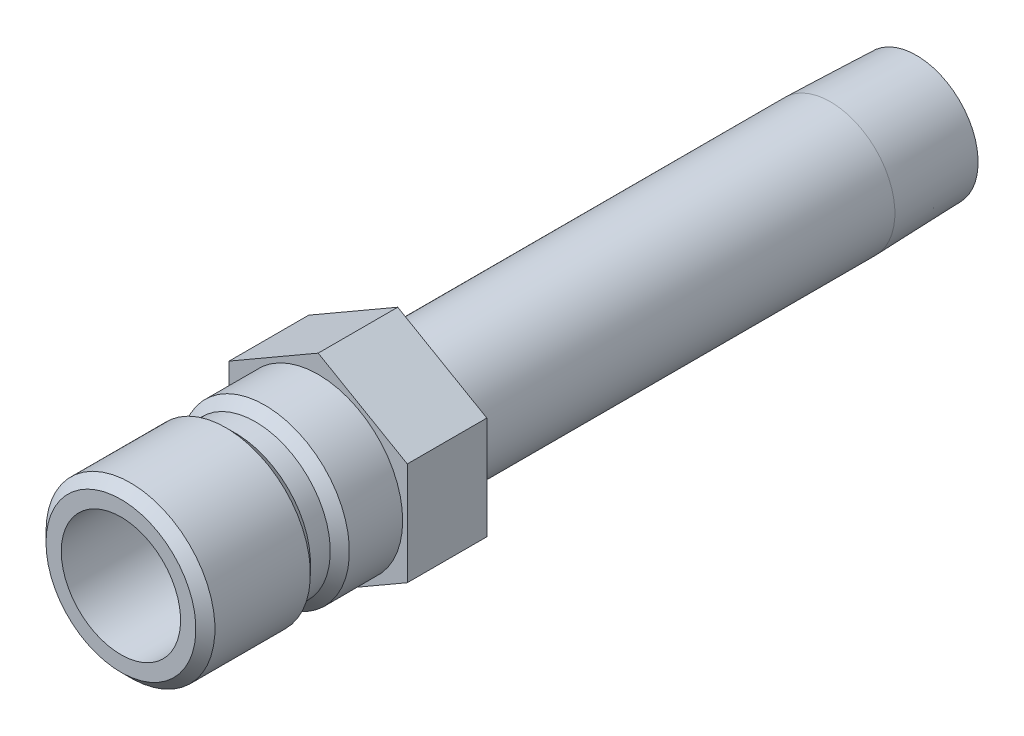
ISO-10303-21;
HEADER;
FILE_DESCRIPTION(('STEP AP214'),'2;1');
FILE_NAME('part.step','',(''),(''),'','','');
FILE_SCHEMA(('AUTOMOTIVE_DESIGN { 1 0 10303 214 1 1 1 1 }'));
ENDSEC;
DATA;
#1=APPLICATION_CONTEXT('core data for automotive mechanical design processes');
#2=APPLICATION_PROTOCOL_DEFINITION('international standard','automotive_design',2000,#1);
#3=PRODUCT_CONTEXT('',#1,'mechanical');
#4=PRODUCT('Part','Part','',(#3));
#5=PRODUCT_RELATED_PRODUCT_CATEGORY('part','',(#4));
#6=PRODUCT_DEFINITION_FORMATION('','',#4);
#7=PRODUCT_DEFINITION_CONTEXT('part definition',#1,'design');
#8=PRODUCT_DEFINITION('design','',#6,#7);
#9=PRODUCT_DEFINITION_SHAPE('','',#8);
#10=(LENGTH_UNIT() NAMED_UNIT(*) SI_UNIT(.MILLI.,.METRE.));
#11=(NAMED_UNIT(*) PLANE_ANGLE_UNIT() SI_UNIT($,.RADIAN.));
#12=(NAMED_UNIT(*) SI_UNIT($,.STERADIAN.) SOLID_ANGLE_UNIT());
#13=UNCERTAINTY_MEASURE_WITH_UNIT(LENGTH_MEASURE(1.E-05),#10,'distance_accuracy_value','');
#14=(GEOMETRIC_REPRESENTATION_CONTEXT(3) GLOBAL_UNCERTAINTY_ASSIGNED_CONTEXT((#13)) GLOBAL_UNIT_ASSIGNED_CONTEXT((#10,
#11,#12)) REPRESENTATION_CONTEXT('',''));
#15=CARTESIAN_POINT('',(0.,0.,0.));
#16=DIRECTION('',(0.,0.,1.));
#17=DIRECTION('',(1.,0.,0.));
#18=AXIS2_PLACEMENT_3D('',#15,#16,#17);
#19=CARTESIAN_POINT('',(0.,0.,-6.35));
#20=DIRECTION('',(0.,0.,-1.));
#21=DIRECTION('',(-1.,0.,0.));
#22=AXIS2_PLACEMENT_3D('',#19,#20,#21);
#23=CYLINDRICAL_SURFACE('',#22,4.7625);
#24=CARTESIAN_POINT('',(0.,0.,3.556));
#25=DIRECTION('',(0.,0.,-1.));
#26=DIRECTION('',(-1.,0.,0.));
#27=AXIS2_PLACEMENT_3D('',#24,#25,#26);
#28=CIRCLE('',#27,4.7625);
#29=CARTESIAN_POINT('',(-4.7625,0.,3.556));
#30=VERTEX_POINT('',#29);
#31=EDGE_CURVE('E137',#30,#30,#28,.T.);
#32=ORIENTED_EDGE('',*,*,#31,.T.);
#33=EDGE_LOOP('',(#32));
#34=FACE_BOUND('',#33,.T.);
#35=CARTESIAN_POINT('',(0.,0.,15.748));
#36=DIRECTION('',(0.,0.,-1.));
#37=DIRECTION('',(-1.,0.,0.));
#38=AXIS2_PLACEMENT_3D('',#35,#36,#37);
#39=CIRCLE('',#38,4.7625);
#40=CARTESIAN_POINT('',(-4.7625,0.,15.748));
#41=VERTEX_POINT('',#40);
#42=EDGE_CURVE('E41',#41,#41,#39,.T.);
#43=ORIENTED_EDGE('',*,*,#42,.F.);
#44=EDGE_LOOP('',(#43));
#45=FACE_BOUND('',#44,.T.);
#46=ADVANCED_FACE('F33',(#34,#45),#23,.F.);
#47=CARTESIAN_POINT('',(0.,4.7625,15.748));
#48=DIRECTION('',(0.,0.,1.));
#49=DIRECTION('',(1.,0.,0.));
#50=AXIS2_PLACEMENT_3D('',#47,#48,#49);
#51=PLANE('',#50);
#52=ORIENTED_EDGE('',*,*,#42,.T.);
#53=EDGE_LOOP('',(#52));
#54=FACE_BOUND('',#53,.T.);
#55=CARTESIAN_POINT('',(0.,0.,15.748));
#56=DIRECTION('',(0.,0.,-1.));
#57=DIRECTION('',(-1.,0.,0.));
#58=AXIS2_PLACEMENT_3D('',#55,#56,#57);
#59=CIRCLE('',#58,5.9817);
#60=CARTESIAN_POINT('',(-5.9817,0.,15.748));
#61=VERTEX_POINT('',#60);
#62=EDGE_CURVE('E175',#61,#61,#59,.T.);
#63=ORIENTED_EDGE('',*,*,#62,.F.);
#64=EDGE_LOOP('',(#63));
#65=FACE_BOUND('',#64,.T.);
#66=ADVANCED_FACE('F180',(#54,#65),#51,.T.);
#67=CARTESIAN_POINT('',(0.,0.,14.986));
#68=DIRECTION('',(0.,0.,-1.));
#69=DIRECTION('',(-1.,0.,0.));
#70=AXIS2_PLACEMENT_3D('',#67,#68,#69);
#71=CONICAL_SURFACE('',#70,6.7437,0.785398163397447);
#72=ORIENTED_EDGE('',*,*,#62,.T.);
#73=EDGE_LOOP('',(#72));
#74=FACE_BOUND('',#73,.T.);
#75=CARTESIAN_POINT('',(0.,0.,14.986));
#76=DIRECTION('',(0.,0.,-1.));
#77=DIRECTION('',(-1.,0.,0.));
#78=AXIS2_PLACEMENT_3D('',#75,#76,#77);
#79=CIRCLE('',#78,6.7437);
#80=CARTESIAN_POINT('',(-6.7437,0.,14.986));
#81=VERTEX_POINT('',#80);
#82=EDGE_CURVE('E172',#81,#81,#79,.T.);
#83=ORIENTED_EDGE('',*,*,#82,.F.);
#84=EDGE_LOOP('',(#83));
#85=FACE_BOUND('',#84,.T.);
#86=ADVANCED_FACE('F188',(#74,#85),#71,.T.);
#87=CARTESIAN_POINT('',(0.,0.,-6.35));
#88=DIRECTION('',(0.,0.,-1.));
#89=DIRECTION('',(-1.,0.,0.));
#90=AXIS2_PLACEMENT_3D('',#87,#88,#89);
#91=CYLINDRICAL_SURFACE('',#90,6.7437);
#92=ORIENTED_EDGE('',*,*,#82,.T.);
#93=EDGE_LOOP('',(#92));
#94=FACE_BOUND('',#93,.T.);
#95=CARTESIAN_POINT('',(0.,0.,7.366));
#96=DIRECTION('',(0.,0.,-1.));
#97=DIRECTION('',(-1.,0.,0.));
#98=AXIS2_PLACEMENT_3D('',#95,#96,#97);
#99=CIRCLE('',#98,6.7437);
#100=CARTESIAN_POINT('',(-6.7437,0.,7.366));
#101=VERTEX_POINT('',#100);
#102=EDGE_CURVE('E169',#101,#101,#99,.T.);
#103=ORIENTED_EDGE('',*,*,#102,.F.);
#104=EDGE_LOOP('',(#103));
#105=FACE_BOUND('',#104,.T.);
#106=ADVANCED_FACE('F237',(#94,#105),#91,.T.);
#107=CARTESIAN_POINT('',(0.,0.,6.604));
#108=DIRECTION('',(0.,0.,1.));
#109=DIRECTION('',(1.,0.,0.));
#110=AXIS2_PLACEMENT_3D('',#107,#108,#109);
#111=CONICAL_SURFACE('',#110,5.9817,0.785398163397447);
#112=ORIENTED_EDGE('',*,*,#102,.T.);
#113=EDGE_LOOP('',(#112));
#114=FACE_BOUND('',#113,.T.);
#115=CARTESIAN_POINT('',(0.,0.,6.604));
#116=DIRECTION('',(0.,0.,-1.));
#117=DIRECTION('',(-1.,0.,0.));
#118=AXIS2_PLACEMENT_3D('',#115,#116,#117);
#119=CIRCLE('',#118,5.9817);
#120=CARTESIAN_POINT('',(-5.9817,0.,6.604));
#121=VERTEX_POINT('',#120);
#122=EDGE_CURVE('E166',#121,#121,#119,.T.);
#123=ORIENTED_EDGE('',*,*,#122,.F.);
#124=EDGE_LOOP('',(#123));
#125=FACE_BOUND('',#124,.T.);
#126=ADVANCED_FACE('F233',(#114,#125),#111,.T.);
#127=CARTESIAN_POINT('',(0.,0.,-6.35));
#128=DIRECTION('',(0.,0.,-1.));
#129=DIRECTION('',(-1.,0.,0.));
#130=AXIS2_PLACEMENT_3D('',#127,#128,#129);
#131=CYLINDRICAL_SURFACE('',#130,5.9817);
#132=ORIENTED_EDGE('',*,*,#122,.T.);
#133=EDGE_LOOP('',(#132));
#134=FACE_BOUND('',#133,.T.);
#135=CARTESIAN_POINT('',(0.,0.,5.0165));
#136=DIRECTION('',(0.,0.,-1.));
#137=DIRECTION('',(-1.,0.,0.));
#138=AXIS2_PLACEMENT_3D('',#135,#136,#137);
#139=CIRCLE('',#138,5.9817);
#140=CARTESIAN_POINT('',(-5.9817,0.,5.0165));
#141=VERTEX_POINT('',#140);
#142=EDGE_CURVE('E163',#141,#141,#139,.T.);
#143=ORIENTED_EDGE('',*,*,#142,.F.);
#144=EDGE_LOOP('',(#143));
#145=FACE_BOUND('',#144,.T.);
#146=ADVANCED_FACE('F229',(#134,#145),#131,.T.);
#147=CARTESIAN_POINT('',(0.,0.,4.2545));
#148=DIRECTION('',(0.,0.,-1.));
#149=DIRECTION('',(-1.,0.,0.));
#150=AXIS2_PLACEMENT_3D('',#147,#148,#149);
#151=CONICAL_SURFACE('',#150,6.7437,0.785398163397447);
#152=ORIENTED_EDGE('',*,*,#142,.T.);
#153=EDGE_LOOP('',(#152));
#154=FACE_BOUND('',#153,.T.);
#155=CARTESIAN_POINT('',(0.,0.,4.2545));
#156=DIRECTION('',(0.,0.,-1.));
#157=DIRECTION('',(-1.,0.,0.));
#158=AXIS2_PLACEMENT_3D('',#155,#156,#157);
#159=CIRCLE('',#158,6.7437);
#160=CARTESIAN_POINT('',(-6.7437,0.,4.2545));
#161=VERTEX_POINT('',#160);
#162=EDGE_CURVE('E160',#161,#161,#159,.T.);
#163=ORIENTED_EDGE('',*,*,#162,.F.);
#164=EDGE_LOOP('',(#163));
#165=FACE_BOUND('',#164,.T.);
#166=ADVANCED_FACE('F225',(#154,#165),#151,.T.);
#167=CARTESIAN_POINT('',(0.,0.,-6.35));
#168=DIRECTION('',(0.,0.,-1.));
#169=DIRECTION('',(-1.,0.,0.));
#170=AXIS2_PLACEMENT_3D('',#167,#168,#169);
#171=CYLINDRICAL_SURFACE('',#170,6.7437);
#172=CARTESIAN_POINT('',(0.,0.,0.));
#173=DIRECTION('',(0.,0.,1.));
#174=DIRECTION('',(1.,0.,0.));
#175=AXIS2_PLACEMENT_3D('',#172,#173,#174);
#176=CIRCLE('',#175,6.7437);
#177=CARTESIAN_POINT('',(6.7437,0.,0.));
#178=VERTEX_POINT('',#177);
#179=EDGE_CURVE('E11',#178,#178,#176,.F.);
#180=ORIENTED_EDGE('',*,*,#179,.F.);
#181=EDGE_LOOP('',(#180));
#182=FACE_BOUND('',#181,.T.);
#183=ORIENTED_EDGE('',*,*,#162,.T.);
#184=EDGE_LOOP('',(#183));
#185=FACE_BOUND('',#184,.T.);
#186=ADVANCED_FACE('F221',(#182,#185),#171,.T.);
#187=CARTESIAN_POINT('',(0.,6.7437,-6.35));
#188=DIRECTION('',(0.,0.,-1.));
#189=DIRECTION('',(-1.,0.,0.));
#190=AXIS2_PLACEMENT_3D('',#187,#188,#189);
#191=PLANE('',#190);
#192=CARTESIAN_POINT('',(0.,0.,-6.35));
#193=DIRECTION('',(0.,0.,-1.));
#194=DIRECTION('',(-1.,0.,0.));
#195=AXIS2_PLACEMENT_3D('',#192,#193,#194);
#196=CIRCLE('',#195,5.1435);
#197=CARTESIAN_POINT('',(-5.1435,0.,-6.35));
#198=VERTEX_POINT('',#197);
#199=EDGE_CURVE('E157',#198,#198,#196,.T.);
#200=ORIENTED_EDGE('',*,*,#199,.F.);
#201=EDGE_LOOP('',(#200));
#202=FACE_BOUND('',#201,.T.);
#203=DIRECTION('',(-0.866025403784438,-0.5,0.));
#204=VECTOR('',#203,1.);
#205=CARTESIAN_POINT('',(0.,8.21223022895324,-6.35));
#206=LINE('',#205,#204);
#207=CARTESIAN_POINT('',(0.,8.21223022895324,-6.35));
#208=VERTEX_POINT('',#207);
#209=CARTESIAN_POINT('',(-7.112,4.10611511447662,-6.35));
#210=VERTEX_POINT('',#209);
#211=EDGE_CURVE('E135',#208,#210,#206,.T.);
#212=ORIENTED_EDGE('',*,*,#211,.F.);
#213=DIRECTION('',(-0.866025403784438,0.5,0.));
#214=VECTOR('',#213,1.);
#215=CARTESIAN_POINT('',(7.112,4.10611511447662,-6.35));
#216=LINE('',#215,#214);
#217=CARTESIAN_POINT('',(7.112,4.10611511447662,-6.35));
#218=VERTEX_POINT('',#217);
#219=EDGE_CURVE('E110',#218,#208,#216,.T.);
#220=ORIENTED_EDGE('',*,*,#219,.F.);
#221=DIRECTION('',(0.,1.,0.));
#222=VECTOR('',#221,1.);
#223=CARTESIAN_POINT('',(7.112,-4.10611511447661,-6.35));
#224=LINE('',#223,#222);
#225=CARTESIAN_POINT('',(7.112,-4.10611511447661,-6.35));
#226=VERTEX_POINT('',#225);
#227=EDGE_CURVE('E95',#226,#218,#224,.T.);
#228=ORIENTED_EDGE('',*,*,#227,.F.);
#229=DIRECTION('',(0.866025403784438,0.5,0.));
#230=VECTOR('',#229,1.);
#231=CARTESIAN_POINT('',(0.,-8.21223022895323,-6.35));
#232=LINE('',#231,#230);
#233=CARTESIAN_POINT('',(0.,-8.21223022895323,-6.35));
#234=VERTEX_POINT('',#233);
#235=EDGE_CURVE('E108',#234,#226,#232,.T.);
#236=ORIENTED_EDGE('',*,*,#235,.F.);
#237=DIRECTION('',(0.866025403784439,-0.5,0.));
#238=VECTOR('',#237,1.);
#239=CARTESIAN_POINT('',(-7.112,-4.10611511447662,-6.35));
#240=LINE('',#239,#238);
#241=CARTESIAN_POINT('',(-7.112,-4.10611511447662,-6.35));
#242=VERTEX_POINT('',#241);
#243=EDGE_CURVE('E113',#242,#234,#240,.T.);
#244=ORIENTED_EDGE('',*,*,#243,.F.);
#245=DIRECTION('',(0.,-1.,0.));
#246=VECTOR('',#245,1.);
#247=CARTESIAN_POINT('',(-7.112,4.10611511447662,-6.35));
#248=LINE('',#247,#246);
#249=EDGE_CURVE('E115',#210,#242,#248,.T.);
#250=ORIENTED_EDGE('',*,*,#249,.F.);
#251=EDGE_LOOP('',(#212,#220,#228,#236,#244,#250));
#252=FACE_BOUND('',#251,.T.);
#253=ADVANCED_FACE('F106',(#202,#252),#191,.T.);
#254=CARTESIAN_POINT('',(0.,0.,-6.35));
#255=DIRECTION('',(0.,0.,-1.));
#256=DIRECTION('',(-1.,0.,0.));
#257=AXIS2_PLACEMENT_3D('',#254,#255,#256);
#258=CYLINDRICAL_SURFACE('',#257,5.1435);
#259=ORIENTED_EDGE('',*,*,#199,.T.);
#260=EDGE_LOOP('',(#259));
#261=FACE_BOUND('',#260,.T.);
#262=CARTESIAN_POINT('',(0.,0.,-40.894));
#263=DIRECTION('',(0.,0.,-1.));
#264=DIRECTION('',(-1.,0.,0.));
#265=AXIS2_PLACEMENT_3D('',#262,#263,#264);
#266=CIRCLE('',#265,5.1435);
#267=CARTESIAN_POINT('',(-5.1435,0.,-40.894));
#268=VERTEX_POINT('',#267);
#269=EDGE_CURVE('E154',#268,#268,#266,.T.);
#270=ORIENTED_EDGE('',*,*,#269,.F.);
#271=EDGE_LOOP('',(#270));
#272=FACE_BOUND('',#271,.T.);
#273=ADVANCED_FACE('F214',(#261,#272),#258,.T.);
#274=CARTESIAN_POINT('',(0.,0.,-47.752));
#275=DIRECTION('',(0.,0.,1.));
#276=DIRECTION('',(1.,0.,0.));
#277=AXIS2_PLACEMENT_3D('',#274,#275,#276);
#278=CONICAL_SURFACE('',#277,4.9291887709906,0.0312396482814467);
#279=ORIENTED_EDGE('',*,*,#269,.T.);
#280=EDGE_LOOP('',(#279));
#281=FACE_BOUND('',#280,.T.);
#282=CARTESIAN_POINT('',(0.,0.,-47.752));
#283=DIRECTION('',(0.,0.,-1.));
#284=DIRECTION('',(-1.,0.,0.));
#285=AXIS2_PLACEMENT_3D('',#282,#283,#284);
#286=CIRCLE('',#285,4.9291887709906);
#287=CARTESIAN_POINT('',(-4.9291887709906,0.,-47.752));
#288=VERTEX_POINT('',#287);
#289=EDGE_CURVE('E151',#288,#288,#286,.T.);
#290=ORIENTED_EDGE('',*,*,#289,.F.);
#291=EDGE_LOOP('',(#290));
#292=FACE_BOUND('',#291,.T.);
#293=ADVANCED_FACE('F210',(#281,#292),#278,.T.);
#294=CARTESIAN_POINT('',(0.,4.9291887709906,-47.752));
#295=DIRECTION('',(0.,0.,-1.));
#296=DIRECTION('',(-1.,0.,0.));
#297=AXIS2_PLACEMENT_3D('',#294,#295,#296);
#298=PLANE('',#297);
#299=ORIENTED_EDGE('',*,*,#289,.T.);
#300=EDGE_LOOP('',(#299));
#301=FACE_BOUND('',#300,.T.);
#302=CARTESIAN_POINT('',(0.,0.,-47.752));
#303=DIRECTION('',(0.,0.,-1.));
#304=DIRECTION('',(-1.,0.,0.));
#305=AXIS2_PLACEMENT_3D('',#302,#303,#304);
#306=CIRCLE('',#305,3.4163);
#307=CARTESIAN_POINT('',(-3.4163,0.,-47.752));
#308=VERTEX_POINT('',#307);
#309=EDGE_CURVE('E148',#308,#308,#306,.T.);
#310=ORIENTED_EDGE('',*,*,#309,.F.);
#311=EDGE_LOOP('',(#310));
#312=FACE_BOUND('',#311,.T.);
#313=ADVANCED_FACE('F203',(#301,#312),#298,.T.);
#314=CARTESIAN_POINT('',(0.,0.,-6.35));
#315=DIRECTION('',(0.,0.,-1.));
#316=DIRECTION('',(-1.,0.,0.));
#317=AXIS2_PLACEMENT_3D('',#314,#315,#316);
#318=CYLINDRICAL_SURFACE('',#317,3.4163);
#319=ORIENTED_EDGE('',*,*,#309,.T.);
#320=EDGE_LOOP('',(#319));
#321=FACE_BOUND('',#320,.T.);
#322=CARTESIAN_POINT('',(0.,0.,2.84021276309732));
#323=DIRECTION('',(0.,0.,-1.));
#324=DIRECTION('',(-1.,0.,0.));
#325=AXIS2_PLACEMENT_3D('',#322,#323,#324);
#326=CIRCLE('',#325,3.4163);
#327=CARTESIAN_POINT('',(-3.4163,0.,2.84021276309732));
#328=VERTEX_POINT('',#327);
#329=EDGE_CURVE('E145',#328,#328,#326,.T.);
#330=ORIENTED_EDGE('',*,*,#329,.F.);
#331=EDGE_LOOP('',(#330));
#332=FACE_BOUND('',#331,.T.);
#333=ADVANCED_FACE('F194',(#321,#332),#318,.F.);
#334=CARTESIAN_POINT('',(0.,0.,3.556));
#335=DIRECTION('',(0.,0.,1.));
#336=DIRECTION('',(1.,0.,0.));
#337=AXIS2_PLACEMENT_3D('',#334,#335,#336);
#338=CONICAL_SURFACE('',#337,4.7625,1.08210413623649);
#339=ORIENTED_EDGE('',*,*,#329,.T.);
#340=EDGE_LOOP('',(#339));
#341=FACE_BOUND('',#340,.T.);
#342=ORIENTED_EDGE('',*,*,#31,.F.);
#343=EDGE_LOOP('',(#342));
#344=FACE_BOUND('',#343,.T.);
#345=ADVANCED_FACE('F191',(#341,#344),#338,.F.);
#346=CARTESIAN_POINT('',(0.,8.21223022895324,-6.35));
#347=DIRECTION('',(-0.5,0.866025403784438,0.));
#348=DIRECTION('',(-0.866025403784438,-0.500000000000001,0.));
#349=AXIS2_PLACEMENT_3D('',#346,#347,#348);
#350=PLANE('',#349);
#351=DIRECTION('',(-0.866025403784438,-0.5,0.));
#352=VECTOR('',#351,1.);
#353=CARTESIAN_POINT('',(0.,8.21223022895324,0.));
#354=LINE('',#353,#352);
#355=CARTESIAN_POINT('',(0.,8.21223022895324,0.));
#356=VERTEX_POINT('',#355);
#357=CARTESIAN_POINT('',(-7.112,4.10611511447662,0.));
#358=VERTEX_POINT('',#357);
#359=EDGE_CURVE('E120',#356,#358,#354,.T.);
#360=ORIENTED_EDGE('',*,*,#359,.F.);
#361=DIRECTION('',(0.,0.,1.));
#362=VECTOR('',#361,1.);
#363=CARTESIAN_POINT('',(0.,8.21223022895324,-6.35));
#364=LINE('',#363,#362);
#365=EDGE_CURVE('E49',#208,#356,#364,.T.);
#366=ORIENTED_EDGE('',*,*,#365,.F.);
#367=ORIENTED_EDGE('',*,*,#211,.T.);
#368=DIRECTION('',(0.,0.,1.));
#369=VECTOR('',#368,1.);
#370=CARTESIAN_POINT('',(-7.112,4.10611511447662,-6.35));
#371=LINE('',#370,#369);
#372=EDGE_CURVE('E84',#210,#358,#371,.T.);
#373=ORIENTED_EDGE('',*,*,#372,.T.);
#374=EDGE_LOOP('',(#360,#366,#367,#373));
#375=FACE_BOUND('',#374,.T.);
#376=ADVANCED_FACE('F193',(#375),#350,.T.);
#377=CARTESIAN_POINT('',(7.112,4.10611511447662,-6.35));
#378=DIRECTION('',(0.5,0.866025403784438,0.));
#379=DIRECTION('',(-0.866025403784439,0.5,0.));
#380=AXIS2_PLACEMENT_3D('',#377,#378,#379);
#381=PLANE('',#380);
#382=DIRECTION('',(-0.866025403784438,0.5,0.));
#383=VECTOR('',#382,1.);
#384=CARTESIAN_POINT('',(7.112,4.10611511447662,0.));
#385=LINE('',#384,#383);
#386=CARTESIAN_POINT('',(7.112,4.10611511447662,0.));
#387=VERTEX_POINT('',#386);
#388=EDGE_CURVE('E132',#387,#356,#385,.T.);
#389=ORIENTED_EDGE('',*,*,#388,.F.);
#390=DIRECTION('',(0.,0.,1.));
#391=VECTOR('',#390,1.);
#392=CARTESIAN_POINT('',(7.112,4.10611511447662,-6.35));
#393=LINE('',#392,#391);
#394=EDGE_CURVE('E72',#218,#387,#393,.T.);
#395=ORIENTED_EDGE('',*,*,#394,.F.);
#396=ORIENTED_EDGE('',*,*,#219,.T.);
#397=ORIENTED_EDGE('',*,*,#365,.T.);
#398=EDGE_LOOP('',(#389,#395,#396,#397));
#399=FACE_BOUND('',#398,.T.);
#400=ADVANCED_FACE('F201',(#399),#381,.T.);
#401=CARTESIAN_POINT('',(7.112,-4.10611511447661,-6.35));
#402=DIRECTION('',(1.,0.,0.));
#403=DIRECTION('',(0.,1.,0.));
#404=AXIS2_PLACEMENT_3D('',#401,#402,#403);
#405=PLANE('',#404);
#406=DIRECTION('',(0.,1.,0.));
#407=VECTOR('',#406,1.);
#408=CARTESIAN_POINT('',(7.112,-4.10611511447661,0.));
#409=LINE('',#408,#407);
#410=CARTESIAN_POINT('',(7.112,-4.10611511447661,0.));
#411=VERTEX_POINT('',#410);
#412=EDGE_CURVE('E97',#411,#387,#409,.T.);
#413=ORIENTED_EDGE('',*,*,#412,.F.);
#414=DIRECTION('',(0.,0.,1.));
#415=VECTOR('',#414,1.);
#416=CARTESIAN_POINT('',(7.112,-4.10611511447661,-6.35));
#417=LINE('',#416,#415);
#418=EDGE_CURVE('E92',#226,#411,#417,.T.);
#419=ORIENTED_EDGE('',*,*,#418,.F.);
#420=ORIENTED_EDGE('',*,*,#227,.T.);
#421=ORIENTED_EDGE('',*,*,#394,.T.);
#422=EDGE_LOOP('',(#413,#419,#420,#421));
#423=FACE_BOUND('',#422,.T.);
#424=ADVANCED_FACE('F94',(#423),#405,.T.);
#425=CARTESIAN_POINT('',(0.,-8.21223022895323,-6.35));
#426=DIRECTION('',(0.5,-0.866025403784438,0.));
#427=DIRECTION('',(0.866025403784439,0.5,0.));
#428=AXIS2_PLACEMENT_3D('',#425,#426,#427);
#429=PLANE('',#428);
#430=DIRECTION('',(0.866025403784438,0.5,0.));
#431=VECTOR('',#430,1.);
#432=CARTESIAN_POINT('',(0.,-8.21223022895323,0.));
#433=LINE('',#432,#431);
#434=CARTESIAN_POINT('',(0.,-8.21223022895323,0.));
#435=VERTEX_POINT('',#434);
#436=EDGE_CURVE('E129',#435,#411,#433,.T.);
#437=ORIENTED_EDGE('',*,*,#436,.F.);
#438=DIRECTION('',(0.,0.,1.));
#439=VECTOR('',#438,1.);
#440=CARTESIAN_POINT('',(0.,-8.21223022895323,-6.35));
#441=LINE('',#440,#439);
#442=EDGE_CURVE('E102',#234,#435,#441,.T.);
#443=ORIENTED_EDGE('',*,*,#442,.F.);
#444=ORIENTED_EDGE('',*,*,#235,.T.);
#445=ORIENTED_EDGE('',*,*,#418,.T.);
#446=EDGE_LOOP('',(#437,#443,#444,#445));
#447=FACE_BOUND('',#446,.T.);
#448=ADVANCED_FACE('F112',(#447),#429,.T.);
#449=CARTESIAN_POINT('',(-7.112,-4.10611511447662,-6.35));
#450=DIRECTION('',(-0.5,-0.866025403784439,0.));
#451=DIRECTION('',(0.866025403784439,-0.5,0.));
#452=AXIS2_PLACEMENT_3D('',#449,#450,#451);
#453=PLANE('',#452);
#454=DIRECTION('',(0.866025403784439,-0.5,0.));
#455=VECTOR('',#454,1.);
#456=CARTESIAN_POINT('',(-7.112,-4.10611511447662,0.));
#457=LINE('',#456,#455);
#458=CARTESIAN_POINT('',(-7.112,-4.10611511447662,0.));
#459=VERTEX_POINT('',#458);
#460=EDGE_CURVE('E126',#459,#435,#457,.T.);
#461=ORIENTED_EDGE('',*,*,#460,.F.);
#462=DIRECTION('',(0.,0.,1.));
#463=VECTOR('',#462,1.);
#464=CARTESIAN_POINT('',(-7.112,-4.10611511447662,-6.35));
#465=LINE('',#464,#463);
#466=EDGE_CURVE('E140',#242,#459,#465,.T.);
#467=ORIENTED_EDGE('',*,*,#466,.F.);
#468=ORIENTED_EDGE('',*,*,#243,.T.);
#469=ORIENTED_EDGE('',*,*,#442,.T.);
#470=EDGE_LOOP('',(#461,#467,#468,#469));
#471=FACE_BOUND('',#470,.T.);
#472=ADVANCED_FACE('F338',(#471),#453,.T.);
#473=CARTESIAN_POINT('',(-7.112,4.10611511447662,-6.35));
#474=DIRECTION('',(-1.,0.,0.));
#475=DIRECTION('',(0.,-1.,0.));
#476=AXIS2_PLACEMENT_3D('',#473,#474,#475);
#477=PLANE('',#476);
#478=DIRECTION('',(0.,-1.,0.));
#479=VECTOR('',#478,1.);
#480=CARTESIAN_POINT('',(-7.112,4.10611511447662,0.));
#481=LINE('',#480,#479);
#482=EDGE_CURVE('E123',#358,#459,#481,.T.);
#483=ORIENTED_EDGE('',*,*,#482,.F.);
#484=ORIENTED_EDGE('',*,*,#372,.F.);
#485=ORIENTED_EDGE('',*,*,#249,.T.);
#486=ORIENTED_EDGE('',*,*,#466,.T.);
#487=EDGE_LOOP('',(#483,#484,#485,#486));
#488=FACE_BOUND('',#487,.T.);
#489=ADVANCED_FACE('F346',(#488),#477,.T.);
#490=CARTESIAN_POINT('',(-7.112,4.10611511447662,0.));
#491=DIRECTION('',(0.,0.,1.));
#492=DIRECTION('',(1.,0.,0.));
#493=AXIS2_PLACEMENT_3D('',#490,#491,#492);
#494=PLANE('',#493);
#495=ORIENTED_EDGE('',*,*,#179,.T.);
#496=EDGE_LOOP('',(#495));
#497=FACE_BOUND('',#496,.T.);
#498=ORIENTED_EDGE('',*,*,#359,.T.);
#499=ORIENTED_EDGE('',*,*,#482,.T.);
#500=ORIENTED_EDGE('',*,*,#460,.T.);
#501=ORIENTED_EDGE('',*,*,#436,.T.);
#502=ORIENTED_EDGE('',*,*,#412,.T.);
#503=ORIENTED_EDGE('',*,*,#388,.T.);
#504=EDGE_LOOP('',(#498,#499,#500,#501,#502,#503));
#505=FACE_BOUND('',#504,.T.);
#506=ADVANCED_FACE('F355',(#497,#505),#494,.T.);
#507=CLOSED_SHELL('',(#46,#66,#86,#106,#126,#146,#166,#186,#253,#273,#293,#313,#333,#345,#376,
#400,#424,#448,#472,#489,#506));
#508=MANIFOLD_SOLID_BREP('B2',#507);
#509=ADVANCED_BREP_SHAPE_REPRESENTATION('',(#18,#508),#14);
#510=SHAPE_DEFINITION_REPRESENTATION(#9,#509);
ENDSEC;
END-ISO-10303-21;
